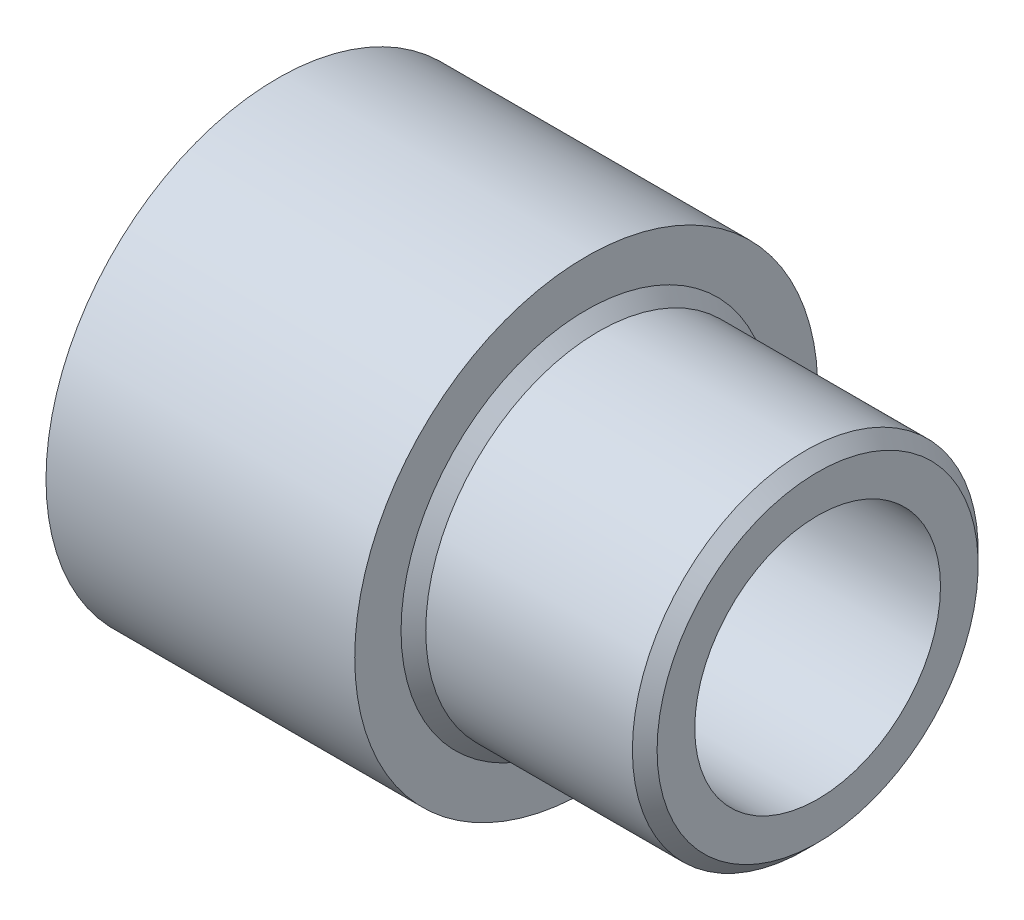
from build123d import *

# Parameters (mm, degrees)
SKETCH1_R                  = 14.2875
OD_EXTRUDE1_DEPTH          = 19.05
SKETCH4_R                  = 10.668
MALETHD_EXTRUDE2_DEPTH     = 14.2748
CHAMFER1_SIZE              = 0.762
SKETCH6_R                  = 10.8204
SOCKET_CUT_EXTRUDE1_DEPTH  = 15.875
SKETCH7_R                  = 7.5819
THRUDIA_CUT_EXTRUDE2_DEPTH = 27.697581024


with BuildPart() as part:
    # Sketch1 → OD-Extrude1 (new body)
    with BuildSketch(Plane(origin=(0, 0, 0), x_dir=(0, 0, -1), z_dir=(1, 0, 0))):
        with Locations(Location((0, 0, 0), (0, 0, 180))):
            Circle(SKETCH1_R)
    extrude(amount=OD_EXTRUDE1_DEPTH)

    # Sketch4 → MaleTHD-Extrude2 (add)
    with BuildSketch(Plane.ZY.offset(-19.05)):
        Circle(SKETCH4_R)
    extrude(amount=-MALETHD_EXTRUDE2_DEPTH)

    # Chamfer1
    chamfer1_edges = [part.edges().sort_by_distance(p)[0] for p in [
        (19.05, 0, -10.668),
        (33.3248, 0, -10.668),
    ]]
    chamfer(chamfer1_edges, length=CHAMFER1_SIZE)

    # Sketch6 → SOCKET-Cut-Extrude1 (cut)
    with BuildSketch(Plane.ZY):
        Circle(SKETCH6_R)
    extrude(amount=-SOCKET_CUT_EXTRUDE1_DEPTH, mode=Mode.SUBTRACT)

    # Sketch7 → ThruDIA-Cut-Extrude2 (cut, through all)
    with BuildSketch(Plane(origin=(15.875, 0, 0), x_dir=(0, 0, -1), z_dir=(1, 0, 0))):
        Circle(SKETCH7_R)
    extrude(amount=THRUDIA_CUT_EXTRUDE2_DEPTH, mode=Mode.SUBTRACT)


solid = part.part
